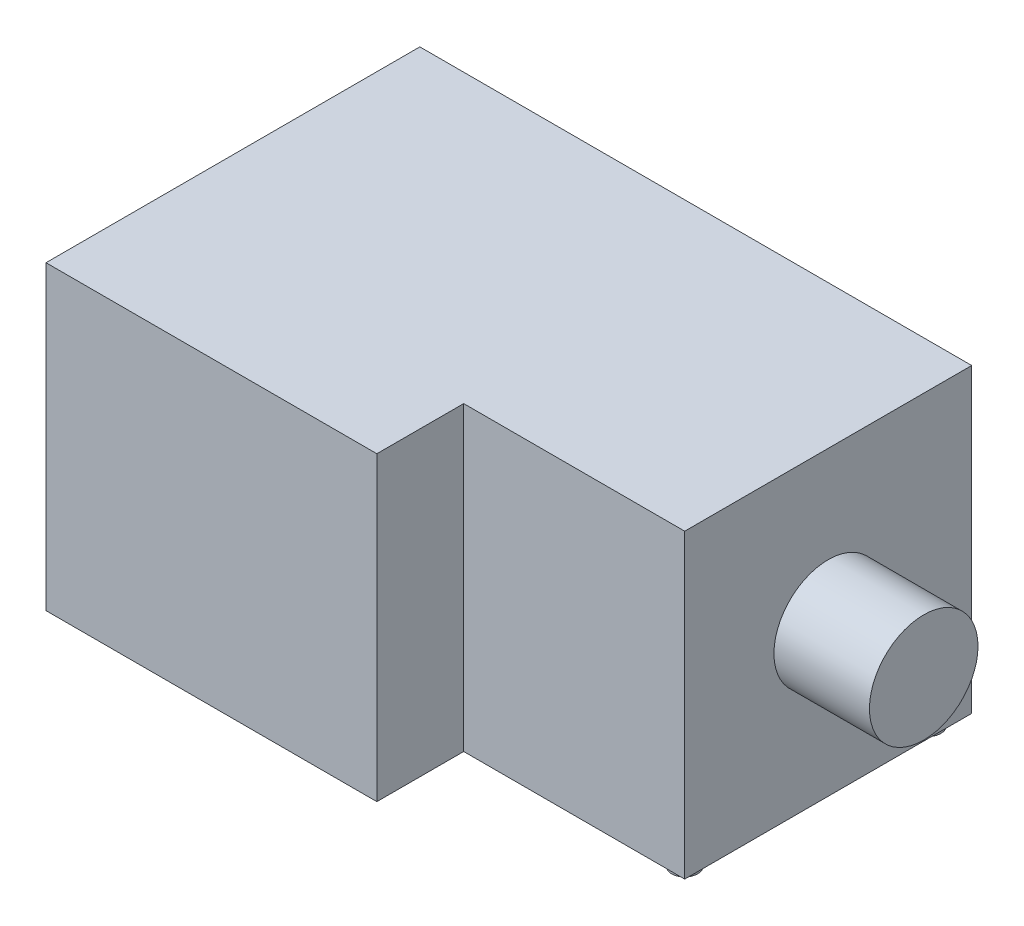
from build123d import *

# Parameters (mm, degrees)
SKETCH1_W           = 1271
SKETCH1_H           = 661
SKETCH1_W_2         = 762
SKETCH1_H_2         = 200
BOSS_EXTRUDE1_DEPTH = 694
SKETCH3_R           = 125
BOSS_EXTRUDE3_DEPTH = 220
SKETCH4_R           = 30
SKETCH4_R_2         = 5
BOSS_EXTRUDE4_DEPTH = 25


with BuildPart() as part:
    # Sketch1 → Boss-Extrude1 (new body)
    with BuildSketch(Plane(origin=(0, 0, 0), x_dir=(1, 0, 0), z_dir=(0, 1, 0))):
        with Locations((635.5, 330.5)):
            Rectangle(SKETCH1_W, SKETCH1_H)
        with Locations((381, -100)):
            Rectangle(SKETCH1_W_2, SKETCH1_H_2)
    extrude(amount=BOSS_EXTRUDE1_DEPTH)

    # Sketch3 → Boss-Extrude3 (add)
    with BuildSketch(Plane(origin=(1271, 0, 0), x_dir=(0, 0, -1), z_dir=(1, 0, 0))):
        with Locations(Location((330.5, 347, 0), (0, 0, 180))):
            Circle(SKETCH3_R)
    extrude(amount=BOSS_EXTRUDE3_DEPTH)

    # Sketch4 → Boss-Extrude4 (add)
    # profile 1 of 4: a face of its own
    with BuildSketch(Plane.XZ):
        with Locations(Location((50.5, -50.5, 0), (0, 0, 90))):
            Circle(SKETCH4_R)
        with Locations(Location((50.5, -50.5, 0), (0, 0, 270))):
            Circle(SKETCH4_R_2, mode=Mode.SUBTRACT)
    # profile 2 of 4: a face of its own
    with BuildSketch(Plane.XZ):
        with Locations(Location((50.5, -610.5, 0), (0, 0, 90))):
            Circle(SKETCH4_R)
        with Locations(Location((50.5, -610.5, 0), (0, 0, 270))):
            Circle(SKETCH4_R_2, mode=Mode.SUBTRACT)
    # profile 3 of 4: a face of its own
    with BuildSketch(Plane.XZ):
        with Locations(Location((1220.5, -610.5, 0), (0, 0, 90))):
            Circle(SKETCH4_R)
        with Locations(Location((1220.5, -610.5, 0), (0, 0, 270))):
            Circle(SKETCH4_R_2, mode=Mode.SUBTRACT)
    # profile 4 of 4: a face of its own
    with BuildSketch(Plane.XZ):
        with Locations(Location((1220.5, -50.5, 0), (0, 0, 90))):
            Circle(SKETCH4_R)
        with Locations(Location((1220.5, -50.5, 0), (0, 0, 270))):
            Circle(SKETCH4_R_2, mode=Mode.SUBTRACT)
    extrude(amount=BOSS_EXTRUDE4_DEPTH)


solid = part.part
